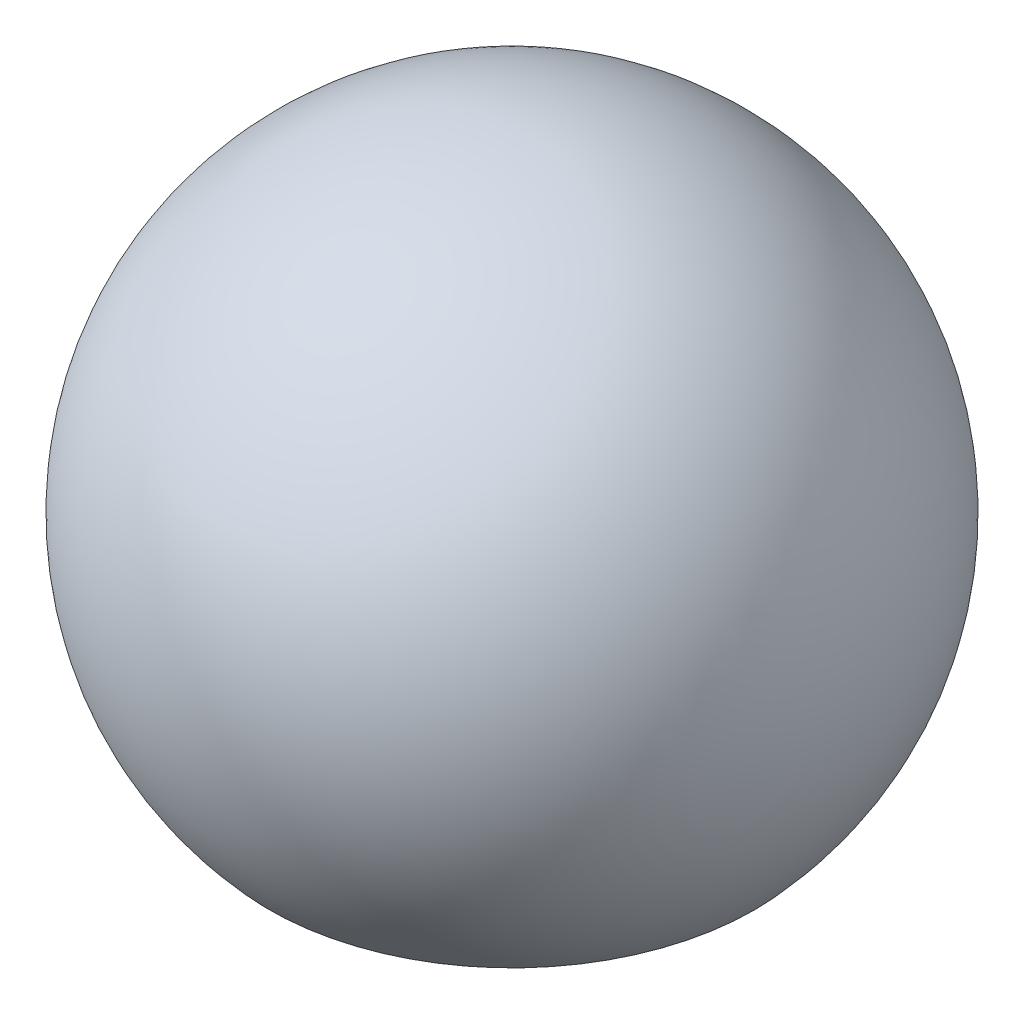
from build123d import *


with BuildPart() as part:
    # Sketch2 → Revolve1 (revolve)
    with BuildSketch(Plane.XY):
        with BuildLine():
            Line((0, 10), (2.5, 10))
            Line((2.5, 10), (2.5, 5))
            Line((2.5, 5), (7.36063395, 3.230873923))
            ThreePointArc((7.36063395, 3.230873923), (9.156725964, 14.019249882), (0, 20))
            Line((0, 20), (0, 10))
        make_face()
    revolve(axis=Axis((0, 0, 0), (0, 1, 0)))


solid = part.part
